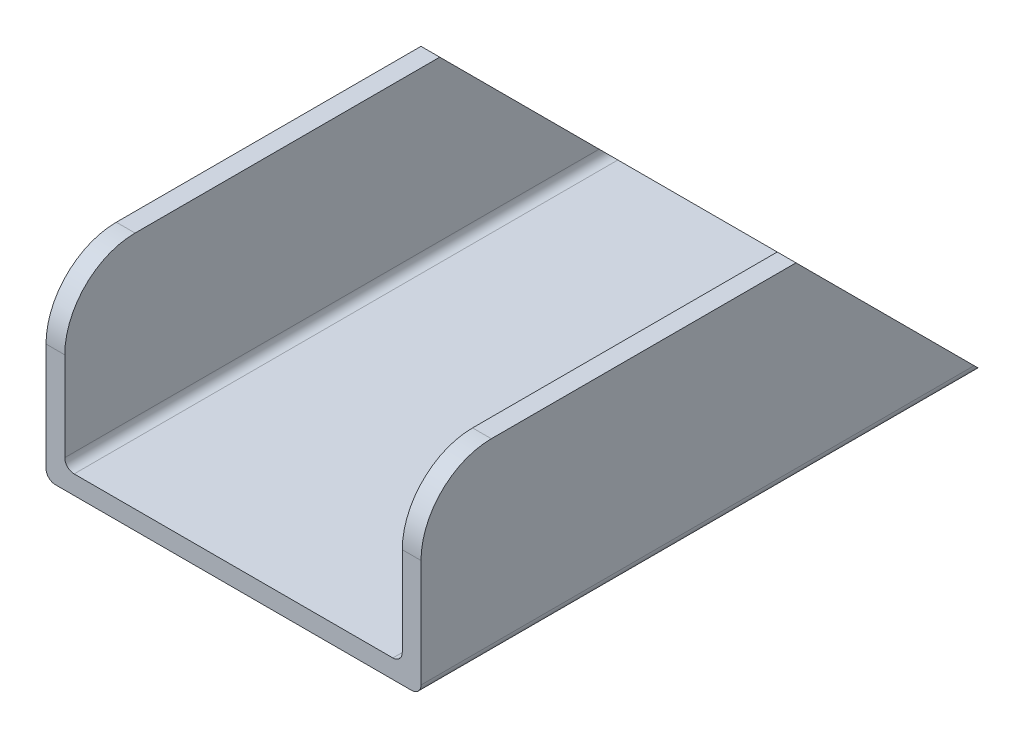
ISO-10303-21;
HEADER;
FILE_DESCRIPTION(('STEP AP214'),'2;1');
FILE_NAME('part.step','',(''),(''),'','','');
FILE_SCHEMA(('AUTOMOTIVE_DESIGN { 1 0 10303 214 1 1 1 1 }'));
ENDSEC;
DATA;
#1=APPLICATION_CONTEXT('core data for automotive mechanical design processes');
#2=APPLICATION_PROTOCOL_DEFINITION('international standard','automotive_design',2000,#1);
#3=PRODUCT_CONTEXT('',#1,'mechanical');
#4=PRODUCT('Part','Part','',(#3));
#5=PRODUCT_RELATED_PRODUCT_CATEGORY('part','',(#4));
#6=PRODUCT_DEFINITION_FORMATION('','',#4);
#7=PRODUCT_DEFINITION_CONTEXT('part definition',#1,'design');
#8=PRODUCT_DEFINITION('design','',#6,#7);
#9=PRODUCT_DEFINITION_SHAPE('','',#8);
#10=(LENGTH_UNIT() NAMED_UNIT(*) SI_UNIT(.MILLI.,.METRE.));
#11=(NAMED_UNIT(*) PLANE_ANGLE_UNIT() SI_UNIT($,.RADIAN.));
#12=(NAMED_UNIT(*) SI_UNIT($,.STERADIAN.) SOLID_ANGLE_UNIT());
#13=UNCERTAINTY_MEASURE_WITH_UNIT(LENGTH_MEASURE(1.E-05),#10,'distance_accuracy_value','');
#14=(GEOMETRIC_REPRESENTATION_CONTEXT(3) GLOBAL_UNCERTAINTY_ASSIGNED_CONTEXT((#13)) GLOBAL_UNIT_ASSIGNED_CONTEXT((#10,
#11,#12)) REPRESENTATION_CONTEXT('',''));
#15=CARTESIAN_POINT('',(0.,0.,0.));
#16=DIRECTION('',(0.,0.,1.));
#17=DIRECTION('',(1.,0.,0.));
#18=AXIS2_PLACEMENT_3D('',#15,#16,#17);
#19=CARTESIAN_POINT('',(40.,39.9999999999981,120.));
#20=DIRECTION('',(0.,-0.999999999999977,0.));
#21=DIRECTION('',(0.,0.,-0.999999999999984));
#22=AXIS2_PLACEMENT_3D('',#19,#20,#21);
#23=PLANE('',#22);
#24=DIRECTION('',(0.,0.,-0.999999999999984));
#25=VECTOR('',#24,1.);
#26=CARTESIAN_POINT('',(36.0000000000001,40.,120.));
#27=LINE('',#26,#25);
#28=CARTESIAN_POINT('',(35.9999999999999,40.,105.));
#29=VERTEX_POINT('',#28);
#30=CARTESIAN_POINT('',(36.,40.,39.9999999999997));
#31=VERTEX_POINT('',#30);
#32=EDGE_CURVE('E270',#29,#31,#27,.T.);
#33=ORIENTED_EDGE('',*,*,#32,.F.);
#34=DIRECTION('',(-1.00000000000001,0.,0.));
#35=VECTOR('',#34,1.);
#36=CARTESIAN_POINT('',(40.0000000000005,39.9999999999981,105.000000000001));
#37=LINE('',#36,#35);
#38=CARTESIAN_POINT('',(40.0000000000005,39.9999999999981,105.000000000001));
#39=VERTEX_POINT('',#38);
#40=EDGE_CURVE('E49',#29,#39,#37,.F.);
#41=ORIENTED_EDGE('',*,*,#40,.T.);
#42=DIRECTION('',(0.,0.,-0.999999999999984));
#43=VECTOR('',#42,1.);
#44=CARTESIAN_POINT('',(40.,39.9999999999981,120.));
#45=LINE('',#44,#43);
#46=CARTESIAN_POINT('',(40.0000000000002,40.,40.));
#47=VERTEX_POINT('',#46);
#48=EDGE_CURVE('E153',#39,#47,#45,.T.);
#49=ORIENTED_EDGE('',*,*,#48,.T.);
#50=DIRECTION('',(1.00000000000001,0.,0.));
#51=VECTOR('',#50,1.);
#52=CARTESIAN_POINT('',(-322.0828693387,40.0000000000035,40.));
#53=LINE('',#52,#51);
#54=EDGE_CURVE('E169',#31,#47,#53,.T.);
#55=ORIENTED_EDGE('',*,*,#54,.F.);
#56=EDGE_LOOP('',(#33,#41,#49,#55));
#57=FACE_BOUND('',#56,.T.);
#58=ADVANCED_FACE('F40',(#57),#23,.F.);
#59=CARTESIAN_POINT('',(-35.9999999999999,40.0000000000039,119.999999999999));
#60=DIRECTION('',(0.,-0.999999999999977,0.));
#61=DIRECTION('',(0.,0.,-0.999999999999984));
#62=AXIS2_PLACEMENT_3D('',#59,#60,#61);
#63=PLANE('',#62);
#64=DIRECTION('',(0.,0.,-0.999999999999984));
#65=VECTOR('',#64,1.);
#66=CARTESIAN_POINT('',(-40.,40.0000000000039,119.999999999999));
#67=LINE('',#66,#65);
#68=CARTESIAN_POINT('',(-39.9999999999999,40.0000000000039,105.));
#69=VERTEX_POINT('',#68);
#70=CARTESIAN_POINT('',(-40.0000000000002,40.0000000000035,39.9999999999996));
#71=VERTEX_POINT('',#70);
#72=EDGE_CURVE('E248',#69,#71,#67,.T.);
#73=ORIENTED_EDGE('',*,*,#72,.F.);
#74=DIRECTION('',(-1.00000000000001,0.,0.));
#75=VECTOR('',#74,1.);
#76=CARTESIAN_POINT('',(-35.9999999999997,40.0000000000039,105.));
#77=LINE('',#76,#75);
#78=CARTESIAN_POINT('',(-35.9999999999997,40.0000000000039,105.));
#79=VERTEX_POINT('',#78);
#80=EDGE_CURVE('E284',#69,#79,#77,.F.);
#81=ORIENTED_EDGE('',*,*,#80,.T.);
#82=DIRECTION('',(0.,0.,-0.999999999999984));
#83=VECTOR('',#82,1.);
#84=CARTESIAN_POINT('',(-35.9999999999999,40.0000000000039,119.999999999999));
#85=LINE('',#84,#83);
#86=CARTESIAN_POINT('',(-36.0000000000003,40.0000000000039,39.9999999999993));
#87=VERTEX_POINT('',#86);
#88=EDGE_CURVE('E251',#79,#87,#85,.T.);
#89=ORIENTED_EDGE('',*,*,#88,.T.);
#90=EDGE_CURVE('E171',#71,#87,#53,.T.);
#91=ORIENTED_EDGE('',*,*,#90,.F.);
#92=EDGE_LOOP('',(#73,#81,#89,#91));
#93=FACE_BOUND('',#92,.T.);
#94=ADVANCED_FACE('F352',(#93),#63,.F.);
#95=CARTESIAN_POINT('',(36.0000000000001,40.,120.));
#96=DIRECTION('',(1.00000000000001,0.,0.));
#97=DIRECTION('',(0.,0.999999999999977,0.));
#98=AXIS2_PLACEMENT_3D('',#95,#96,#97);
#99=PLANE('',#98);
#100=DIRECTION('',(0.,-0.999999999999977,0.));
#101=VECTOR('',#100,1.);
#102=CARTESIAN_POINT('',(36.0000000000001,40.,120.));
#103=LINE('',#102,#101);
#104=CARTESIAN_POINT('',(36.0000000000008,25.,119.999999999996));
#105=VERTEX_POINT('',#104);
#106=CARTESIAN_POINT('',(36.0000000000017,6.00000000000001,119.999999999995));
#107=VERTEX_POINT('',#106);
#108=EDGE_CURVE('E204',#105,#107,#103,.T.);
#109=ORIENTED_EDGE('',*,*,#108,.F.);
#110=CARTESIAN_POINT('',(36.0000000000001,25.,104.999999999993));
#111=DIRECTION('',(1.00000000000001,0.,0.));
#112=DIRECTION('',(0.,0.999999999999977,0.));
#113=AXIS2_PLACEMENT_3D('',#110,#111,#112);
#114=CIRCLE('',#113,15.);
#115=EDGE_CURVE('E63',#105,#29,#114,.F.);
#116=ORIENTED_EDGE('',*,*,#115,.T.);
#117=ORIENTED_EDGE('',*,*,#32,.T.);
#118=DIRECTION('',(0.,0.707106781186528,0.707106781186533));
#119=VECTOR('',#118,1.);
#120=CARTESIAN_POINT('',(36.0000000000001,80.0000000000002,79.9999999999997));
#121=LINE('',#120,#119);
#122=CARTESIAN_POINT('',(36.0000000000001,6.00000000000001,5.99999999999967));
#123=VERTEX_POINT('',#122);
#124=EDGE_CURVE('E200',#123,#31,#121,.T.);
#125=ORIENTED_EDGE('',*,*,#124,.F.);
#126=DIRECTION('',(0.,0.,-0.999999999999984));
#127=VECTOR('',#126,1.);
#128=CARTESIAN_POINT('',(36.0000000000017,6.00000000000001,119.999999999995));
#129=LINE('',#128,#127);
#130=EDGE_CURVE('E266',#107,#123,#129,.T.);
#131=ORIENTED_EDGE('',*,*,#130,.F.);
#132=EDGE_LOOP('',(#109,#116,#117,#125,#131));
#133=FACE_BOUND('',#132,.T.);
#134=ADVANCED_FACE('F375',(#133),#99,.F.);
#135=CARTESIAN_POINT('',(34.0000000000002,6.00000000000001,120.));
#136=DIRECTION('',(0.,0.,-0.999999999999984));
#137=DIRECTION('',(-1.00000000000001,0.,0.));
#138=AXIS2_PLACEMENT_3D('',#135,#136,#137);
#139=CYLINDRICAL_SURFACE('',#138,2.);
#140=CARTESIAN_POINT('',(34.0000000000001,6.00000000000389,6.00000000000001));
#141=DIRECTION('',(0.,0.707106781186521,-0.707106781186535));
#142=DIRECTION('',(0.,-0.707106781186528,-0.707106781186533));
#143=AXIS2_PLACEMENT_3D('',#140,#141,#142);
#144=ELLIPSE('',#143,2.82842712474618,2.);
#145=CARTESIAN_POINT('',(34.0000000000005,4.,3.9999999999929));
#146=VERTEX_POINT('',#145);
#147=EDGE_CURVE('E197',#146,#123,#144,.F.);
#148=ORIENTED_EDGE('',*,*,#147,.F.);
#149=DIRECTION('',(0.,0.,-0.999999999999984));
#150=VECTOR('',#149,1.);
#151=CARTESIAN_POINT('',(34.0000000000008,4.,119.999999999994));
#152=LINE('',#151,#150);
#153=CARTESIAN_POINT('',(34.0000000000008,4.,119.999999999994));
#154=VERTEX_POINT('',#153);
#155=EDGE_CURVE('E262',#154,#146,#152,.T.);
#156=ORIENTED_EDGE('',*,*,#155,.F.);
#157=CARTESIAN_POINT('',(34.0000000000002,6.00000000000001,120.));
#158=DIRECTION('',(0.,0.,-0.999999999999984));
#159=DIRECTION('',(-1.00000000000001,0.,0.));
#160=AXIS2_PLACEMENT_3D('',#157,#158,#159);
#161=CIRCLE('',#160,2.);
#162=EDGE_CURVE('E207',#107,#154,#161,.T.);
#163=ORIENTED_EDGE('',*,*,#162,.F.);
#164=ORIENTED_EDGE('',*,*,#130,.T.);
#165=EDGE_LOOP('',(#148,#156,#163,#164));
#166=FACE_BOUND('',#165,.T.);
#167=ADVANCED_FACE('F405',(#166),#139,.F.);
#168=CARTESIAN_POINT('',(34.0000000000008,4.,119.999999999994));
#169=DIRECTION('',(0.,-0.999999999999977,0.));
#170=DIRECTION('',(1.00000000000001,0.,0.));
#171=AXIS2_PLACEMENT_3D('',#168,#169,#170);
#172=PLANE('',#171);
#173=DIRECTION('',(1.00000000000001,0.,0.));
#174=VECTOR('',#173,1.);
#175=CARTESIAN_POINT('',(34.0000000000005,4.,3.9999999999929));
#176=LINE('',#175,#174);
#177=CARTESIAN_POINT('',(-34.0000000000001,4.,3.9999999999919));
#178=VERTEX_POINT('',#177);
#179=EDGE_CURVE('E193',#178,#146,#176,.T.);
#180=ORIENTED_EDGE('',*,*,#179,.F.);
#181=DIRECTION('',(0.,0.,-0.999999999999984));
#182=VECTOR('',#181,1.);
#183=CARTESIAN_POINT('',(-34.,4.,119.999999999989));
#184=LINE('',#183,#182);
#185=CARTESIAN_POINT('',(-34.,4.,119.999999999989));
#186=VERTEX_POINT('',#185);
#187=EDGE_CURVE('E258',#186,#178,#184,.T.);
#188=ORIENTED_EDGE('',*,*,#187,.F.);
#189=DIRECTION('',(-1.00000000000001,0.,0.));
#190=VECTOR('',#189,1.);
#191=CARTESIAN_POINT('',(34.0000000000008,4.,119.999999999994));
#192=LINE('',#191,#190);
#193=EDGE_CURVE('E210',#154,#186,#192,.T.);
#194=ORIENTED_EDGE('',*,*,#193,.F.);
#195=ORIENTED_EDGE('',*,*,#155,.T.);
#196=EDGE_LOOP('',(#180,#188,#194,#195));
#197=FACE_BOUND('',#196,.T.);
#198=ADVANCED_FACE('F402',(#197),#172,.F.);
#199=CARTESIAN_POINT('',(-33.9999999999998,6.00000000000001,119.999999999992));
#200=DIRECTION('',(0.,0.,-0.999999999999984));
#201=DIRECTION('',(-1.00000000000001,0.,0.));
#202=AXIS2_PLACEMENT_3D('',#199,#200,#201);
#203=CYLINDRICAL_SURFACE('',#202,2.);
#204=CARTESIAN_POINT('',(-34.0000000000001,6.00000000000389,5.99999999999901));
#205=DIRECTION('',(0.,0.707106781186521,-0.707106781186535));
#206=DIRECTION('',(0.,-0.707106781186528,-0.707106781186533));
#207=AXIS2_PLACEMENT_3D('',#204,#205,#206);
#208=ELLIPSE('',#207,2.82842712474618,2.);
#209=CARTESIAN_POINT('',(-36.,6.00000000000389,5.99999999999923));
#210=VERTEX_POINT('',#209);
#211=EDGE_CURVE('E189',#210,#178,#208,.F.);
#212=ORIENTED_EDGE('',*,*,#211,.F.);
#213=DIRECTION('',(0.,0.,-0.999999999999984));
#214=VECTOR('',#213,1.);
#215=CARTESIAN_POINT('',(-36.,6.00000000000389,119.999999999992));
#216=LINE('',#215,#214);
#217=CARTESIAN_POINT('',(-36.,6.00000000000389,119.999999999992));
#218=VERTEX_POINT('',#217);
#219=EDGE_CURVE('E254',#218,#210,#216,.T.);
#220=ORIENTED_EDGE('',*,*,#219,.F.);
#221=CARTESIAN_POINT('',(-33.9999999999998,6.00000000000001,119.999999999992));
#222=DIRECTION('',(0.,0.,-0.999999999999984));
#223=DIRECTION('',(-1.00000000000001,0.,0.));
#224=AXIS2_PLACEMENT_3D('',#221,#222,#223);
#225=CIRCLE('',#224,2.);
#226=EDGE_CURVE('E213',#186,#218,#225,.T.);
#227=ORIENTED_EDGE('',*,*,#226,.F.);
#228=ORIENTED_EDGE('',*,*,#187,.T.);
#229=EDGE_LOOP('',(#212,#220,#227,#228));
#230=FACE_BOUND('',#229,.T.);
#231=ADVANCED_FACE('F399',(#230),#203,.F.);
#232=CARTESIAN_POINT('',(-36.,6.00000000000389,119.999999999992));
#233=DIRECTION('',(-1.00000000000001,0.,0.));
#234=DIRECTION('',(0.,-0.999999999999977,0.));
#235=AXIS2_PLACEMENT_3D('',#232,#233,#234);
#236=PLANE('',#235);
#237=ORIENTED_EDGE('',*,*,#88,.F.);
#238=CARTESIAN_POINT('',(-35.9999999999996,25.0000000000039,104.99999999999));
#239=DIRECTION('',(-1.00000000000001,0.,0.));
#240=DIRECTION('',(0.,-0.999999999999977,0.));
#241=AXIS2_PLACEMENT_3D('',#238,#239,#240);
#242=CIRCLE('',#241,15.);
#243=CARTESIAN_POINT('',(-36.,25.0000000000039,119.99999999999));
#244=VERTEX_POINT('',#243);
#245=EDGE_CURVE('E287',#79,#244,#242,.F.);
#246=ORIENTED_EDGE('',*,*,#245,.T.);
#247=DIRECTION('',(0.,0.999999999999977,0.));
#248=VECTOR('',#247,1.);
#249=CARTESIAN_POINT('',(-36.,6.00000000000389,119.999999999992));
#250=LINE('',#249,#248);
#251=EDGE_CURVE('E216',#218,#244,#250,.T.);
#252=ORIENTED_EDGE('',*,*,#251,.F.);
#253=ORIENTED_EDGE('',*,*,#219,.T.);
#254=DIRECTION('',(0.,-0.707106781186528,-0.707106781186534));
#255=VECTOR('',#254,1.);
#256=CARTESIAN_POINT('',(-36.0000000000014,63.0000000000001,62.9999999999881));
#257=LINE('',#256,#255);
#258=EDGE_CURVE('E185',#87,#210,#257,.T.);
#259=ORIENTED_EDGE('',*,*,#258,.F.);
#260=EDGE_LOOP('',(#237,#246,#252,#253,#259));
#261=FACE_BOUND('',#260,.T.);
#262=ADVANCED_FACE('F335',(#261),#236,.F.);
#263=CARTESIAN_POINT('',(-40.,40.0000000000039,119.999999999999));
#264=DIRECTION('',(1.00000000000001,0.,0.));
#265=DIRECTION('',(0.,0.,-0.999999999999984));
#266=AXIS2_PLACEMENT_3D('',#263,#264,#265);
#267=PLANE('',#266);
#268=DIRECTION('',(0.,-0.999999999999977,0.));
#269=VECTOR('',#268,1.);
#270=CARTESIAN_POINT('',(-40.,40.0000000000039,119.999999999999));
#271=LINE('',#270,#269);
#272=CARTESIAN_POINT('',(-40.0000000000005,25.0000000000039,119.999999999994));
#273=VERTEX_POINT('',#272);
#274=CARTESIAN_POINT('',(-40.0000000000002,2.00000000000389,119.999999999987));
#275=VERTEX_POINT('',#274);
#276=EDGE_CURVE('E220',#273,#275,#271,.T.);
#277=ORIENTED_EDGE('',*,*,#276,.F.);
#278=CARTESIAN_POINT('',(-39.9999999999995,25.0000000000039,104.999999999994));
#279=DIRECTION('',(1.00000000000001,0.,0.));
#280=DIRECTION('',(0.,0.,-0.999999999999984));
#281=AXIS2_PLACEMENT_3D('',#278,#279,#280);
#282=CIRCLE('',#281,15.);
#283=EDGE_CURVE('E281',#273,#69,#282,.F.);
#284=ORIENTED_EDGE('',*,*,#283,.T.);
#285=ORIENTED_EDGE('',*,*,#72,.T.);
#286=DIRECTION('',(0.,0.707106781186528,0.707106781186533));
#287=VECTOR('',#286,1.);
#288=CARTESIAN_POINT('',(-40.0000000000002,79.9999999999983,79.9999999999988));
#289=LINE('',#288,#287);
#290=CARTESIAN_POINT('',(-40.,2.,1.99999999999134));
#291=VERTEX_POINT('',#290);
#292=EDGE_CURVE('E181',#291,#71,#289,.T.);
#293=ORIENTED_EDGE('',*,*,#292,.F.);
#294=DIRECTION('',(0.,0.,-0.999999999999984));
#295=VECTOR('',#294,1.);
#296=CARTESIAN_POINT('',(-40.0000000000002,2.00000000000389,119.999999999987));
#297=LINE('',#296,#295);
#298=EDGE_CURVE('E244',#275,#291,#297,.T.);
#299=ORIENTED_EDGE('',*,*,#298,.F.);
#300=EDGE_LOOP('',(#277,#284,#285,#293,#299));
#301=FACE_BOUND('',#300,.T.);
#302=ADVANCED_FACE('F348',(#301),#267,.F.);
#303=CARTESIAN_POINT('',(-38.0000000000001,2.00000000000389,119.999999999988));
#304=DIRECTION('',(0.,0.,-0.999999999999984));
#305=DIRECTION('',(-1.00000000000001,0.,0.));
#306=AXIS2_PLACEMENT_3D('',#303,#304,#305);
#307=CYLINDRICAL_SURFACE('',#306,2.);
#308=CARTESIAN_POINT('',(-38.,2.,1.99999999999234));
#309=DIRECTION('',(0.,0.707106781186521,-0.707106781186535));
#310=DIRECTION('',(0.,-0.707106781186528,-0.707106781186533));
#311=AXIS2_PLACEMENT_3D('',#308,#309,#310);
#312=ELLIPSE('',#311,2.82842712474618,2.);
#313=CARTESIAN_POINT('',(-38.,3.88578058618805E-12,0.));
#314=VERTEX_POINT('',#313);
#315=EDGE_CURVE('E163',#314,#291,#312,.T.);
#316=ORIENTED_EDGE('',*,*,#315,.F.);
#317=DIRECTION('',(0.,0.,-0.999999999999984));
#318=VECTOR('',#317,1.);
#319=CARTESIAN_POINT('',(-38.,3.88578058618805E-12,120.));
#320=LINE('',#319,#318);
#321=CARTESIAN_POINT('',(-38.,3.88578058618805E-12,120.));
#322=VERTEX_POINT('',#321);
#323=EDGE_CURVE('E240',#322,#314,#320,.T.);
#324=ORIENTED_EDGE('',*,*,#323,.F.);
#325=CARTESIAN_POINT('',(-38.0000000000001,2.00000000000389,119.999999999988));
#326=DIRECTION('',(0.,0.,0.999999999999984));
#327=DIRECTION('',(-1.00000000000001,0.,0.));
#328=AXIS2_PLACEMENT_3D('',#325,#326,#327);
#329=CIRCLE('',#328,2.);
#330=EDGE_CURVE('E223',#275,#322,#329,.T.);
#331=ORIENTED_EDGE('',*,*,#330,.F.);
#332=ORIENTED_EDGE('',*,*,#298,.T.);
#333=EDGE_LOOP('',(#316,#324,#331,#332));
#334=FACE_BOUND('',#333,.T.);
#335=ADVANCED_FACE('F355',(#334),#307,.T.);
#336=CARTESIAN_POINT('',(38.0000000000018,2.,119.999999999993));
#337=DIRECTION('',(0.,0.,-0.999999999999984));
#338=DIRECTION('',(-1.00000000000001,0.,0.));
#339=AXIS2_PLACEMENT_3D('',#336,#337,#338);
#340=CYLINDRICAL_SURFACE('',#339,2.);
#341=CARTESIAN_POINT('',(38.0000000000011,2.00000000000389,1.99999999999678));
#342=DIRECTION('',(0.,0.707106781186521,-0.707106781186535));
#343=DIRECTION('',(0.,-0.707106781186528,-0.707106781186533));
#344=AXIS2_PLACEMENT_3D('',#341,#342,#343);
#345=ELLIPSE('',#344,2.82842712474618,2.);
#346=CARTESIAN_POINT('',(40.0000000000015,2.,1.99999999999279));
#347=VERTEX_POINT('',#346);
#348=CARTESIAN_POINT('',(38.0000000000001,0.,2.22044604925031E-13));
#349=VERTEX_POINT('',#348);
#350=EDGE_CURVE('E157',#347,#349,#345,.T.);
#351=ORIENTED_EDGE('',*,*,#350,.F.);
#352=DIRECTION('',(0.,0.,-0.999999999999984));
#353=VECTOR('',#352,1.);
#354=CARTESIAN_POINT('',(40.,2.00000000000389,119.999999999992));
#355=LINE('',#354,#353);
#356=CARTESIAN_POINT('',(40.,2.00000000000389,119.999999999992));
#357=VERTEX_POINT('',#356);
#358=EDGE_CURVE('E141',#357,#347,#355,.T.);
#359=ORIENTED_EDGE('',*,*,#358,.F.);
#360=CARTESIAN_POINT('',(38.0000000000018,2.,119.999999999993));
#361=DIRECTION('',(0.,0.,0.999999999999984));
#362=DIRECTION('',(1.00000000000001,0.,0.));
#363=AXIS2_PLACEMENT_3D('',#360,#361,#362);
#364=CIRCLE('',#363,2.);
#365=CARTESIAN_POINT('',(38.0000000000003,0.,120.));
#366=VERTEX_POINT('',#365);
#367=EDGE_CURVE('E229',#366,#357,#364,.T.);
#368=ORIENTED_EDGE('',*,*,#367,.F.);
#369=DIRECTION('',(0.,0.,-0.999999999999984));
#370=VECTOR('',#369,1.);
#371=CARTESIAN_POINT('',(38.0000000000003,0.,120.));
#372=LINE('',#371,#370);
#373=EDGE_CURVE('E152',#366,#349,#372,.T.);
#374=ORIENTED_EDGE('',*,*,#373,.T.);
#375=EDGE_LOOP('',(#351,#359,#368,#374));
#376=FACE_BOUND('',#375,.T.);
#377=ADVANCED_FACE('F158',(#376),#340,.T.);
#378=CARTESIAN_POINT('',(40.,2.00000000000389,119.999999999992));
#379=DIRECTION('',(-1.00000000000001,0.,0.));
#380=DIRECTION('',(0.,0.,0.999999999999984));
#381=AXIS2_PLACEMENT_3D('',#378,#379,#380);
#382=PLANE('',#381);
#383=ORIENTED_EDGE('',*,*,#48,.F.);
#384=CARTESIAN_POINT('',(40.,25.0000000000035,104.999999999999));
#385=DIRECTION('',(-1.00000000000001,0.,0.));
#386=DIRECTION('',(0.,0.,0.999999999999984));
#387=AXIS2_PLACEMENT_3D('',#384,#385,#386);
#388=CIRCLE('',#387,15.);
#389=CARTESIAN_POINT('',(39.9999999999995,25.0000000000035,119.999999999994));
#390=VERTEX_POINT('',#389);
#391=EDGE_CURVE('E11',#39,#390,#388,.F.);
#392=ORIENTED_EDGE('',*,*,#391,.T.);
#393=DIRECTION('',(0.,0.999999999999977,0.));
#394=VECTOR('',#393,1.);
#395=CARTESIAN_POINT('',(40.,2.00000000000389,119.999999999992));
#396=LINE('',#395,#394);
#397=EDGE_CURVE('E148',#357,#390,#396,.T.);
#398=ORIENTED_EDGE('',*,*,#397,.F.);
#399=ORIENTED_EDGE('',*,*,#358,.T.);
#400=DIRECTION('',(0.,-0.707106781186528,-0.707106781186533));
#401=VECTOR('',#400,1.);
#402=CARTESIAN_POINT('',(40.,61.,60.9999999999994));
#403=LINE('',#402,#401);
#404=EDGE_CURVE('E145',#47,#347,#403,.T.);
#405=ORIENTED_EDGE('',*,*,#404,.F.);
#406=EDGE_LOOP('',(#383,#392,#398,#399,#405));
#407=FACE_BOUND('',#406,.T.);
#408=ADVANCED_FACE('F143',(#407),#382,.F.);
#409=CARTESIAN_POINT('',(-38.,3.88578058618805E-12,120.));
#410=DIRECTION('',(0.,0.999999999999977,0.));
#411=DIRECTION('',(0.,0.,0.999999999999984));
#412=AXIS2_PLACEMENT_3D('',#409,#410,#411);
#413=PLANE('',#412);
#414=DIRECTION('',(1.00000000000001,0.,0.));
#415=VECTOR('',#414,1.);
#416=CARTESIAN_POINT('',(-38.,3.88578058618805E-12,0.));
#417=LINE('',#416,#415);
#418=EDGE_CURVE('E203',#314,#349,#417,.T.);
#419=ORIENTED_EDGE('',*,*,#418,.T.);
#420=ORIENTED_EDGE('',*,*,#373,.F.);
#421=DIRECTION('',(1.00000000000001,0.,0.));
#422=VECTOR('',#421,1.);
#423=CARTESIAN_POINT('',(-38.,3.88578058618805E-12,120.));
#424=LINE('',#423,#422);
#425=EDGE_CURVE('E226',#322,#366,#424,.T.);
#426=ORIENTED_EDGE('',*,*,#425,.F.);
#427=ORIENTED_EDGE('',*,*,#323,.T.);
#428=EDGE_LOOP('',(#419,#420,#426,#427));
#429=FACE_BOUND('',#428,.T.);
#430=ADVANCED_FACE('F359',(#429),#413,.F.);
#431=CARTESIAN_POINT('',(34.0000000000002,6.00000000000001,120.));
#432=DIRECTION('',(0.,0.,-0.999999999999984));
#433=DIRECTION('',(-1.00000000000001,0.,0.));
#434=AXIS2_PLACEMENT_3D('',#431,#432,#433);
#435=PLANE('',#434);
#436=ORIENTED_EDGE('',*,*,#251,.T.);
#437=DIRECTION('',(-1.00000000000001,0.,0.));
#438=VECTOR('',#437,1.);
#439=CARTESIAN_POINT('',(34.0000000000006,25.,119.999999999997));
#440=LINE('',#439,#438);
#441=EDGE_CURVE('E277',#244,#273,#440,.T.);
#442=ORIENTED_EDGE('',*,*,#441,.T.);
#443=ORIENTED_EDGE('',*,*,#276,.T.);
#444=ORIENTED_EDGE('',*,*,#330,.T.);
#445=ORIENTED_EDGE('',*,*,#425,.T.);
#446=ORIENTED_EDGE('',*,*,#367,.T.);
#447=ORIENTED_EDGE('',*,*,#397,.T.);
#448=DIRECTION('',(-1.00000000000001,0.,0.));
#449=VECTOR('',#448,1.);
#450=CARTESIAN_POINT('',(34.0000000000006,25.,119.999999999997));
#451=LINE('',#450,#449);
#452=EDGE_CURVE('E273',#390,#105,#451,.T.);
#453=ORIENTED_EDGE('',*,*,#452,.T.);
#454=ORIENTED_EDGE('',*,*,#108,.T.);
#455=ORIENTED_EDGE('',*,*,#162,.T.);
#456=ORIENTED_EDGE('',*,*,#193,.T.);
#457=ORIENTED_EDGE('',*,*,#226,.T.);
#458=EDGE_LOOP('',(#436,#442,#443,#444,#445,#446,#447,#453,#454,#455,#456,#457));
#459=FACE_BOUND('',#458,.T.);
#460=ADVANCED_FACE('F341',(#459),#435,.F.);
#461=CARTESIAN_POINT('',(-322.082869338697,3.88578058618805E-12,0.));
#462=DIRECTION('',(0.,0.707106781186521,-0.707106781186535));
#463=DIRECTION('',(0.,0.707106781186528,0.707106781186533));
#464=AXIS2_PLACEMENT_3D('',#461,#462,#463);
#465=PLANE('',#464);
#466=ORIENTED_EDGE('',*,*,#147,.T.);
#467=ORIENTED_EDGE('',*,*,#124,.T.);
#468=ORIENTED_EDGE('',*,*,#54,.T.);
#469=ORIENTED_EDGE('',*,*,#404,.T.);
#470=ORIENTED_EDGE('',*,*,#350,.T.);
#471=ORIENTED_EDGE('',*,*,#418,.F.);
#472=ORIENTED_EDGE('',*,*,#315,.T.);
#473=ORIENTED_EDGE('',*,*,#292,.T.);
#474=ORIENTED_EDGE('',*,*,#90,.T.);
#475=ORIENTED_EDGE('',*,*,#258,.T.);
#476=ORIENTED_EDGE('',*,*,#211,.T.);
#477=ORIENTED_EDGE('',*,*,#179,.T.);
#478=EDGE_LOOP('',(#466,#467,#468,#469,#470,#471,#472,#473,#474,#475,#476,#477));
#479=FACE_BOUND('',#478,.T.);
#480=ADVANCED_FACE('F166',(#479),#465,.T.);
#481=CARTESIAN_POINT('',(34.0000000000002,25.,104.999999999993));
#482=DIRECTION('',(-1.00000000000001,0.,0.));
#483=DIRECTION('',(0.,0.,0.999999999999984));
#484=AXIS2_PLACEMENT_3D('',#481,#482,#483);
#485=CYLINDRICAL_SURFACE('',#484,15.);
#486=ORIENTED_EDGE('',*,*,#245,.F.);
#487=ORIENTED_EDGE('',*,*,#80,.F.);
#488=ORIENTED_EDGE('',*,*,#283,.F.);
#489=ORIENTED_EDGE('',*,*,#441,.F.);
#490=EDGE_LOOP('',(#486,#487,#488,#489));
#491=FACE_BOUND('',#490,.T.);
#492=ADVANCED_FACE('F345',(#491),#485,.T.);
#493=CARTESIAN_POINT('',(34.0000000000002,25.,104.999999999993));
#494=DIRECTION('',(-1.00000000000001,0.,0.));
#495=DIRECTION('',(0.,0.,0.999999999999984));
#496=AXIS2_PLACEMENT_3D('',#493,#494,#495);
#497=CYLINDRICAL_SURFACE('',#496,15.);
#498=ORIENTED_EDGE('',*,*,#391,.F.);
#499=ORIENTED_EDGE('',*,*,#40,.F.);
#500=ORIENTED_EDGE('',*,*,#115,.F.);
#501=ORIENTED_EDGE('',*,*,#452,.F.);
#502=EDGE_LOOP('',(#498,#499,#500,#501));
#503=FACE_BOUND('',#502,.T.);
#504=ADVANCED_FACE('F42',(#503),#497,.T.);
#505=CLOSED_SHELL('',(#58,#94,#134,#167,#198,#231,#262,#302,#335,#377,#408,#430,#460,#480,#492,#504));
#506=MANIFOLD_SOLID_BREP('B2',#505);
#507=ADVANCED_BREP_SHAPE_REPRESENTATION('',(#18,#506),#14);
#508=SHAPE_DEFINITION_REPRESENTATION(#9,#507);
ENDSEC;
END-ISO-10303-21;
